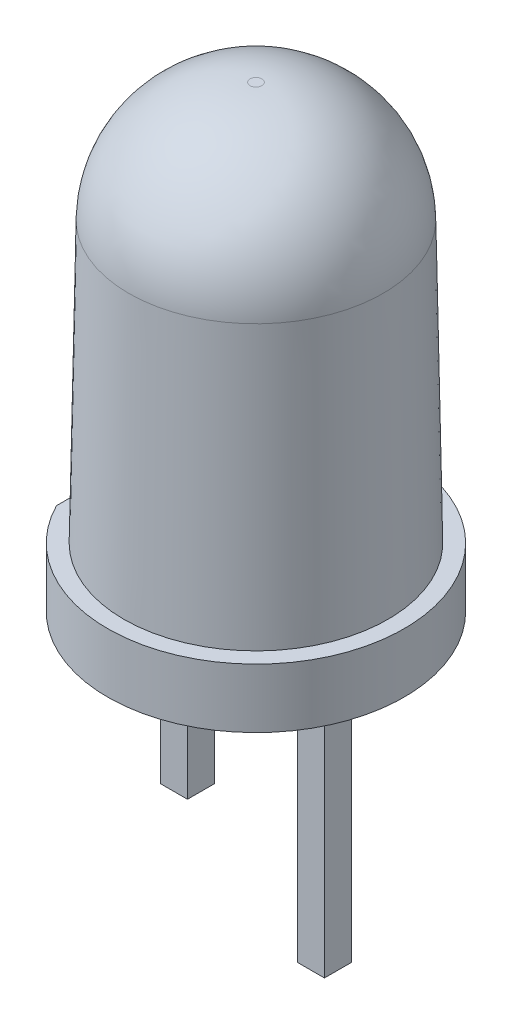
from build123d import *

# Parameters (mm, degrees)
SKETCH1_R           = 2.75
BOSS_EXTRUDE1_DEPTH = 1.1
SKETCH2_R           = 2.45
DRAFT1_ANGLE        = 1
FILLET1_R           = 2.25
CUT_EXTRUDE1_START  = -1.1
CUT_EXTRUDE1_DEPTH  = 1.1
SKETCH6_W           = 0.5
SKETCH6_H           = 0.5
BOSS_EXTRUDE2_DEPTH = 5
MOVE_FACE1_BY       = 1.6


with BuildPart() as part:
    # Sketch1 → Boss-Extrude1 (new body)
    with BuildSketch(Plane(origin=(0, 0, 0), x_dir=(1, 0, 0), z_dir=(0, 1, 0))):
        with Locations(Location((0, 0, 0), (0, 0, 270))):
            Circle(SKETCH1_R)
    extrude(amount=BOSS_EXTRUDE1_DEPTH)

    # Sweep1: sweep along a path in Sketch3
    with BuildLine(Plane.XY) as sweep1_path:
        Line((0, 1.1), (0, 8.5))
    # Sketch2 → Sweep1 (sweep)
    with BuildSketch(Plane(origin=(0, 1.1, 0), x_dir=(1, 0, 0), z_dir=(0, 1, 0))):
        Circle(SKETCH2_R)
    sweep(path=sweep1_path.line)

    # Draft1
    draft1_faces = [part.faces().sort_by_distance(p)[0] for p in [
        (-2.45, 4.8, 0),
    ]]
    draft(draft1_faces, Plane.ZX.offset(1.1), DRAFT1_ANGLE)

    # Fillet1
    fillet1_edges = [part.edges().sort_by_distance(p)[0] for p in [
        (-2.32083252, 8.5, 0),
    ]]
    fillet(fillet1_edges, radius=FILLET1_R)

    # Sketch5 → Cut-Extrude1 (cut)
    with BuildSketch(Plane(origin=(0, 1.1, 0), x_dir=(1, 0, 0), z_dir=(0, 1, 0)).offset(CUT_EXTRUDE1_START)):
        with BuildLine():
            Line((-2.45, 1.2489996), (-2.45, -1.2489996))
            ThreePointArc((-2.45, -1.2489996), (-2.75, 0), (-2.45, 1.2489996))
        make_face()
    extrude(amount=CUT_EXTRUDE1_DEPTH, mode=Mode.SUBTRACT)

    # Sketch6 → Boss-Extrude2 (add)
    with BuildSketch(Plane.XZ):
        with Locations((-1.27, 0)):
            Rectangle(SKETCH6_W, SKETCH6_H)
        with Locations((1.27, 0)):
            Rectangle(SKETCH6_W, SKETCH6_H)
    extrude(amount=BOSS_EXTRUDE2_DEPTH)

    # Move Face1: a face moved inward by 1.6
    extrude(part.faces().sort_by_distance((-1.27, -5, 0))[0], amount=MOVE_FACE1_BY, dir=(0, 1, 0), mode=Mode.SUBTRACT)


solid = part.part
